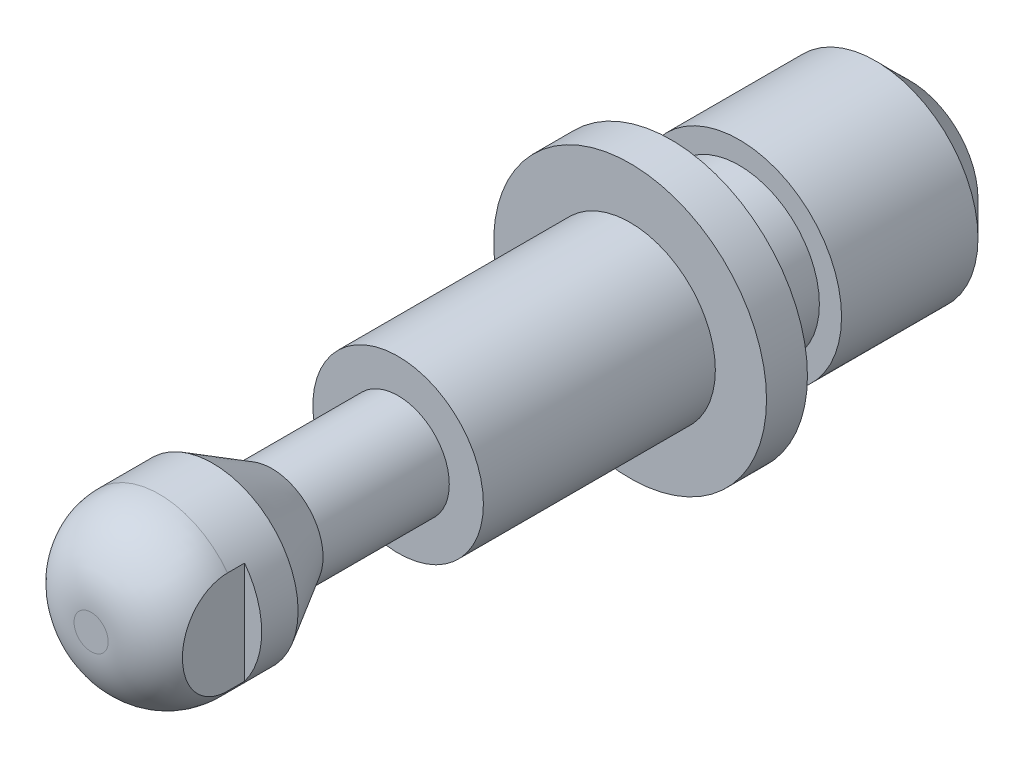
ISO-10303-21;
HEADER;
FILE_DESCRIPTION(('STEP AP214'),'2;1');
FILE_NAME('part.step','',(''),(''),'','','');
FILE_SCHEMA(('AUTOMOTIVE_DESIGN { 1 0 10303 214 1 1 1 1 }'));
ENDSEC;
DATA;
#1=APPLICATION_CONTEXT('core data for automotive mechanical design processes');
#2=APPLICATION_PROTOCOL_DEFINITION('international standard','automotive_design',2000,#1);
#3=PRODUCT_CONTEXT('',#1,'mechanical');
#4=PRODUCT('Part','Part','',(#3));
#5=PRODUCT_RELATED_PRODUCT_CATEGORY('part','',(#4));
#6=PRODUCT_DEFINITION_FORMATION('','',#4);
#7=PRODUCT_DEFINITION_CONTEXT('part definition',#1,'design');
#8=PRODUCT_DEFINITION('design','',#6,#7);
#9=PRODUCT_DEFINITION_SHAPE('','',#8);
#10=(LENGTH_UNIT() NAMED_UNIT(*) SI_UNIT(.MILLI.,.METRE.));
#11=(NAMED_UNIT(*) PLANE_ANGLE_UNIT() SI_UNIT($,.RADIAN.));
#12=(NAMED_UNIT(*) SI_UNIT($,.STERADIAN.) SOLID_ANGLE_UNIT());
#13=UNCERTAINTY_MEASURE_WITH_UNIT(LENGTH_MEASURE(1.E-05),#10,'distance_accuracy_value','');
#14=(GEOMETRIC_REPRESENTATION_CONTEXT(3) GLOBAL_UNCERTAINTY_ASSIGNED_CONTEXT((#13)) GLOBAL_UNIT_ASSIGNED_CONTEXT((#10,
#11,#12)) REPRESENTATION_CONTEXT('',''));
#15=CARTESIAN_POINT('',(0.,0.,0.));
#16=DIRECTION('',(0.,0.,1.));
#17=DIRECTION('',(1.,0.,0.));
#18=AXIS2_PLACEMENT_3D('',#15,#16,#17);
#19=CARTESIAN_POINT('',(0.,0.,0.));
#20=DIRECTION('',(0.,0.,-1.));
#21=DIRECTION('',(1.,0.,0.));
#22=AXIS2_PLACEMENT_3D('',#19,#20,#21);
#23=CYLINDRICAL_SURFACE('',#22,4.);
#24=CARTESIAN_POINT('',(0.,0.,0.));
#25=DIRECTION('',(0.,0.,-1.));
#26=DIRECTION('',(1.,0.,0.));
#27=AXIS2_PLACEMENT_3D('',#24,#25,#26);
#28=CIRCLE('',#27,4.);
#29=CARTESIAN_POINT('',(4.,0.,0.));
#30=VERTEX_POINT('',#29);
#31=EDGE_CURVE('E92',#30,#30,#28,.T.);
#32=ORIENTED_EDGE('',*,*,#31,.F.);
#33=EDGE_LOOP('',(#32));
#34=FACE_BOUND('',#33,.T.);
#35=CARTESIAN_POINT('',(0.,0.,1.2));
#36=DIRECTION('',(0.,0.,-1.));
#37=DIRECTION('',(1.,0.,0.));
#38=AXIS2_PLACEMENT_3D('',#35,#36,#37);
#39=CIRCLE('',#38,4.);
#40=CARTESIAN_POINT('',(4.,0.,1.2));
#41=VERTEX_POINT('',#40);
#42=EDGE_CURVE('E128',#41,#41,#39,.T.);
#43=ORIENTED_EDGE('',*,*,#42,.T.);
#44=EDGE_LOOP('',(#43));
#45=FACE_BOUND('',#44,.T.);
#46=ADVANCED_FACE('F15',(#34,#45),#23,.T.);
#47=CARTESIAN_POINT('',(0.,-4.,1.2));
#48=DIRECTION('',(0.,0.,-1.));
#49=DIRECTION('',(1.,0.,0.));
#50=AXIS2_PLACEMENT_3D('',#47,#48,#49);
#51=PLANE('',#50);
#52=ORIENTED_EDGE('',*,*,#42,.F.);
#53=EDGE_LOOP('',(#52));
#54=FACE_BOUND('',#53,.T.);
#55=CARTESIAN_POINT('',(0.,0.,1.2));
#56=DIRECTION('',(0.,0.,-1.));
#57=DIRECTION('',(1.,0.,0.));
#58=AXIS2_PLACEMENT_3D('',#55,#56,#57);
#59=CIRCLE('',#58,2.5);
#60=CARTESIAN_POINT('',(2.5,0.,1.2));
#61=VERTEX_POINT('',#60);
#62=EDGE_CURVE('E124',#61,#61,#59,.T.);
#63=ORIENTED_EDGE('',*,*,#62,.T.);
#64=EDGE_LOOP('',(#63));
#65=FACE_BOUND('',#64,.T.);
#66=ADVANCED_FACE('F181',(#54,#65),#51,.F.);
#67=CARTESIAN_POINT('',(0.,0.,0.));
#68=DIRECTION('',(0.,0.,-1.));
#69=DIRECTION('',(1.,0.,0.));
#70=AXIS2_PLACEMENT_3D('',#67,#68,#69);
#71=CYLINDRICAL_SURFACE('',#70,2.5);
#72=ORIENTED_EDGE('',*,*,#62,.F.);
#73=EDGE_LOOP('',(#72));
#74=FACE_BOUND('',#73,.T.);
#75=CARTESIAN_POINT('',(0.,0.,8.));
#76=DIRECTION('',(0.,0.,-1.));
#77=DIRECTION('',(1.,0.,0.));
#78=AXIS2_PLACEMENT_3D('',#75,#76,#77);
#79=CIRCLE('',#78,2.5);
#80=CARTESIAN_POINT('',(2.5,0.,8.));
#81=VERTEX_POINT('',#80);
#82=EDGE_CURVE('E120',#81,#81,#79,.T.);
#83=ORIENTED_EDGE('',*,*,#82,.T.);
#84=EDGE_LOOP('',(#83));
#85=FACE_BOUND('',#84,.T.);
#86=ADVANCED_FACE('F187',(#74,#85),#71,.T.);
#87=CARTESIAN_POINT('',(0.,-1.5,8.));
#88=DIRECTION('',(0.,0.,-1.));
#89=DIRECTION('',(1.,0.,0.));
#90=AXIS2_PLACEMENT_3D('',#87,#88,#89);
#91=PLANE('',#90);
#92=ORIENTED_EDGE('',*,*,#82,.F.);
#93=EDGE_LOOP('',(#92));
#94=FACE_BOUND('',#93,.T.);
#95=CARTESIAN_POINT('',(0.,0.,8.));
#96=DIRECTION('',(0.,0.,-1.));
#97=DIRECTION('',(1.,0.,0.));
#98=AXIS2_PLACEMENT_3D('',#95,#96,#97);
#99=CIRCLE('',#98,1.5);
#100=CARTESIAN_POINT('',(1.5,0.,8.));
#101=VERTEX_POINT('',#100);
#102=EDGE_CURVE('E116',#101,#101,#99,.T.);
#103=ORIENTED_EDGE('',*,*,#102,.T.);
#104=EDGE_LOOP('',(#103));
#105=FACE_BOUND('',#104,.T.);
#106=ADVANCED_FACE('F195',(#94,#105),#91,.F.);
#107=CARTESIAN_POINT('',(0.,0.,0.));
#108=DIRECTION('',(0.,0.,-1.));
#109=DIRECTION('',(1.,0.,0.));
#110=AXIS2_PLACEMENT_3D('',#107,#108,#109);
#111=CYLINDRICAL_SURFACE('',#110,1.5);
#112=ORIENTED_EDGE('',*,*,#102,.F.);
#113=EDGE_LOOP('',(#112));
#114=FACE_BOUND('',#113,.T.);
#115=CARTESIAN_POINT('',(0.,0.,11.7));
#116=DIRECTION('',(0.,0.,-1.));
#117=DIRECTION('',(1.,0.,0.));
#118=AXIS2_PLACEMENT_3D('',#115,#116,#117);
#119=CIRCLE('',#118,1.5);
#120=CARTESIAN_POINT('',(1.5,0.,11.7));
#121=VERTEX_POINT('',#120);
#122=EDGE_CURVE('E112',#121,#121,#119,.T.);
#123=ORIENTED_EDGE('',*,*,#122,.T.);
#124=EDGE_LOOP('',(#123));
#125=FACE_BOUND('',#124,.T.);
#126=ADVANCED_FACE('F199',(#114,#125),#111,.T.);
#127=CARTESIAN_POINT('',(0.,0.,13.4320508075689));
#128=DIRECTION('',(0.,0.,1.));
#129=DIRECTION('',(-1.,0.,0.));
#130=AXIS2_PLACEMENT_3D('',#127,#128,#129);
#131=CONICAL_SURFACE('',#130,2.5,0.523598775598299);
#132=ORIENTED_EDGE('',*,*,#122,.F.);
#133=EDGE_LOOP('',(#132));
#134=FACE_BOUND('',#133,.T.);
#135=CARTESIAN_POINT('',(0.,0.,13.4320508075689));
#136=DIRECTION('',(0.,0.,-1.));
#137=DIRECTION('',(1.,0.,0.));
#138=AXIS2_PLACEMENT_3D('',#135,#136,#137);
#139=CIRCLE('',#138,2.5);
#140=CARTESIAN_POINT('',(2.5,0.,13.4320508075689));
#141=VERTEX_POINT('',#140);
#142=EDGE_CURVE('E108',#141,#141,#139,.T.);
#143=ORIENTED_EDGE('',*,*,#142,.T.);
#144=EDGE_LOOP('',(#143));
#145=FACE_BOUND('',#144,.T.);
#146=ADVANCED_FACE('F203',(#134,#145),#131,.T.);
#147=CARTESIAN_POINT('',(0.,0.,0.));
#148=DIRECTION('',(0.,0.,-1.));
#149=DIRECTION('',(1.,0.,0.));
#150=AXIS2_PLACEMENT_3D('',#147,#148,#149);
#151=CYLINDRICAL_SURFACE('',#150,2.5);
#152=CARTESIAN_POINT('',(0.,0.,15.));
#153=DIRECTION('',(0.,0.,-1.));
#154=DIRECTION('',(1.,0.,0.));
#155=AXIS2_PLACEMENT_3D('',#152,#153,#154);
#156=CIRCLE('',#155,2.5);
#157=CARTESIAN_POINT('',(-2.,1.50000000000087,15.));
#158=VERTEX_POINT('',#157);
#159=CARTESIAN_POINT('',(2.,1.5,15.));
#160=VERTEX_POINT('',#159);
#161=EDGE_CURVE('E75',#158,#160,#156,.T.);
#162=ORIENTED_EDGE('',*,*,#161,.T.);
#163=DIRECTION('',(0.,0.,-1.));
#164=VECTOR('',#163,1.);
#165=CARTESIAN_POINT('',(2.,1.5,0.));
#166=LINE('',#165,#164);
#167=CARTESIAN_POINT('',(2.,1.5,14.5));
#168=VERTEX_POINT('',#167);
#169=EDGE_CURVE('E31',#160,#168,#166,.T.);
#170=ORIENTED_EDGE('',*,*,#169,.T.);
#171=CARTESIAN_POINT('',(0.,0.,14.5));
#172=DIRECTION('',(0.,0.,-1.));
#173=DIRECTION('',(1.,0.,0.));
#174=AXIS2_PLACEMENT_3D('',#171,#172,#173);
#175=CIRCLE('',#174,2.5);
#176=CARTESIAN_POINT('',(2.,-1.5,14.5));
#177=VERTEX_POINT('',#176);
#178=EDGE_CURVE('E60',#168,#177,#175,.T.);
#179=ORIENTED_EDGE('',*,*,#178,.T.);
#180=DIRECTION('',(0.,0.,-1.));
#181=VECTOR('',#180,1.);
#182=CARTESIAN_POINT('',(2.,-1.5,0.));
#183=LINE('',#182,#181);
#184=CARTESIAN_POINT('',(2.,-1.50000000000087,15.));
#185=VERTEX_POINT('',#184);
#186=EDGE_CURVE('E67',#177,#185,#183,.F.);
#187=ORIENTED_EDGE('',*,*,#186,.T.);
#188=CARTESIAN_POINT('',(-2.,-1.5,15.));
#189=VERTEX_POINT('',#188);
#190=EDGE_CURVE('E39',#185,#189,#156,.T.);
#191=ORIENTED_EDGE('',*,*,#190,.T.);
#192=DIRECTION('',(0.,0.,-1.));
#193=VECTOR('',#192,1.);
#194=CARTESIAN_POINT('',(-2.,-1.5,0.));
#195=LINE('',#194,#193);
#196=CARTESIAN_POINT('',(-2.,-1.5,14.5));
#197=VERTEX_POINT('',#196);
#198=EDGE_CURVE('E89',#189,#197,#195,.T.);
#199=ORIENTED_EDGE('',*,*,#198,.T.);
#200=CARTESIAN_POINT('',(0.,0.,14.5));
#201=DIRECTION('',(0.,0.,-1.));
#202=DIRECTION('',(1.,0.,0.));
#203=AXIS2_PLACEMENT_3D('',#200,#201,#202);
#204=CIRCLE('',#203,2.5);
#205=CARTESIAN_POINT('',(-2.,1.5,14.5));
#206=VERTEX_POINT('',#205);
#207=EDGE_CURVE('E146',#197,#206,#204,.T.);
#208=ORIENTED_EDGE('',*,*,#207,.T.);
#209=DIRECTION('',(0.,0.,-1.));
#210=VECTOR('',#209,1.);
#211=CARTESIAN_POINT('',(-2.,1.5,0.));
#212=LINE('',#211,#210);
#213=EDGE_CURVE('E83',#206,#158,#212,.F.);
#214=ORIENTED_EDGE('',*,*,#213,.T.);
#215=EDGE_LOOP('',(#162,#170,#179,#187,#191,#199,#208,#214));
#216=FACE_BOUND('',#215,.T.);
#217=ORIENTED_EDGE('',*,*,#142,.F.);
#218=EDGE_LOOP('',(#217));
#219=FACE_BOUND('',#218,.T.);
#220=ADVANCED_FACE('F71',(#216,#219),#151,.T.);
#221=CARTESIAN_POINT('',(0.,0.,17.));
#222=DIRECTION('',(0.,0.,-1.));
#223=DIRECTION('',(1.,0.,0.));
#224=AXIS2_PLACEMENT_3D('',#221,#222,#223);
#225=PLANE('',#224);
#226=CARTESIAN_POINT('',(0.,0.,17.));
#227=DIRECTION('',(0.,0.,-1.));
#228=DIRECTION('',(1.,0.,0.));
#229=AXIS2_PLACEMENT_3D('',#226,#227,#228);
#230=CIRCLE('',#229,0.5);
#231=CARTESIAN_POINT('',(0.500000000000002,0.,17.));
#232=VERTEX_POINT('',#231);
#233=EDGE_CURVE('E134',#232,#232,#230,.F.);
#234=ORIENTED_EDGE('',*,*,#233,.T.);
#235=EDGE_LOOP('',(#234));
#236=FACE_BOUND('',#235,.T.);
#237=ADVANCED_FACE('F210',(#236),#225,.F.);
#238=CARTESIAN_POINT('',(0.,-3.,-7.));
#239=DIRECTION('',(0.,0.,1.));
#240=DIRECTION('',(-1.,0.,0.));
#241=AXIS2_PLACEMENT_3D('',#238,#239,#240);
#242=PLANE('',#241);
#243=CARTESIAN_POINT('',(0.,0.,-7.));
#244=DIRECTION('',(0.,0.,1.));
#245=DIRECTION('',(1.,0.,0.));
#246=AXIS2_PLACEMENT_3D('',#243,#244,#245);
#247=CIRCLE('',#246,2.);
#248=CARTESIAN_POINT('',(2.,0.,-7.));
#249=VERTEX_POINT('',#248);
#250=EDGE_CURVE('E24',#249,#249,#247,.F.);
#251=ORIENTED_EDGE('',*,*,#250,.T.);
#252=EDGE_LOOP('',(#251));
#253=FACE_BOUND('',#252,.T.);
#254=ADVANCED_FACE('F171',(#253),#242,.F.);
#255=CARTESIAN_POINT('',(0.,0.,0.));
#256=DIRECTION('',(0.,0.,-1.));
#257=DIRECTION('',(1.,0.,0.));
#258=AXIS2_PLACEMENT_3D('',#255,#256,#257);
#259=CYLINDRICAL_SURFACE('',#258,3.);
#260=CARTESIAN_POINT('',(0.,0.,-6.));
#261=DIRECTION('',(0.,0.,1.));
#262=DIRECTION('',(1.,0.,0.));
#263=AXIS2_PLACEMENT_3D('',#260,#261,#262);
#264=CIRCLE('',#263,3.);
#265=CARTESIAN_POINT('',(3.,0.,-6.));
#266=VERTEX_POINT('',#265);
#267=EDGE_CURVE('E9',#266,#266,#264,.T.);
#268=ORIENTED_EDGE('',*,*,#267,.T.);
#269=EDGE_LOOP('',(#268));
#270=FACE_BOUND('',#269,.T.);
#271=CARTESIAN_POINT('',(0.,0.,-2.));
#272=DIRECTION('',(0.,0.,-1.));
#273=DIRECTION('',(1.,0.,0.));
#274=AXIS2_PLACEMENT_3D('',#271,#272,#273);
#275=CIRCLE('',#274,3.);
#276=CARTESIAN_POINT('',(3.,0.,-2.));
#277=VERTEX_POINT('',#276);
#278=EDGE_CURVE('E104',#277,#277,#275,.T.);
#279=ORIENTED_EDGE('',*,*,#278,.T.);
#280=EDGE_LOOP('',(#279));
#281=FACE_BOUND('',#280,.T.);
#282=ADVANCED_FACE('F216',(#270,#281),#259,.T.);
#283=CARTESIAN_POINT('',(0.,-2.35,-2.));
#284=DIRECTION('',(0.,0.,-1.));
#285=DIRECTION('',(1.,0.,0.));
#286=AXIS2_PLACEMENT_3D('',#283,#284,#285);
#287=PLANE('',#286);
#288=ORIENTED_EDGE('',*,*,#278,.F.);
#289=EDGE_LOOP('',(#288));
#290=FACE_BOUND('',#289,.T.);
#291=CARTESIAN_POINT('',(0.,0.,-2.));
#292=DIRECTION('',(0.,0.,-1.));
#293=DIRECTION('',(1.,0.,0.));
#294=AXIS2_PLACEMENT_3D('',#291,#292,#293);
#295=CIRCLE('',#294,2.35);
#296=CARTESIAN_POINT('',(2.35,0.,-2.));
#297=VERTEX_POINT('',#296);
#298=EDGE_CURVE('E100',#297,#297,#295,.T.);
#299=ORIENTED_EDGE('',*,*,#298,.T.);
#300=EDGE_LOOP('',(#299));
#301=FACE_BOUND('',#300,.T.);
#302=ADVANCED_FACE('F219',(#290,#301),#287,.F.);
#303=CARTESIAN_POINT('',(0.,0.,0.));
#304=DIRECTION('',(0.,0.,-1.));
#305=DIRECTION('',(1.,0.,0.));
#306=AXIS2_PLACEMENT_3D('',#303,#304,#305);
#307=CYLINDRICAL_SURFACE('',#306,2.35);
#308=ORIENTED_EDGE('',*,*,#298,.F.);
#309=EDGE_LOOP('',(#308));
#310=FACE_BOUND('',#309,.T.);
#311=CARTESIAN_POINT('',(0.,0.,0.));
#312=DIRECTION('',(0.,0.,-1.));
#313=DIRECTION('',(1.,0.,0.));
#314=AXIS2_PLACEMENT_3D('',#311,#312,#313);
#315=CIRCLE('',#314,2.35);
#316=CARTESIAN_POINT('',(2.35,0.,0.));
#317=VERTEX_POINT('',#316);
#318=EDGE_CURVE('E96',#317,#317,#315,.T.);
#319=ORIENTED_EDGE('',*,*,#318,.T.);
#320=EDGE_LOOP('',(#319));
#321=FACE_BOUND('',#320,.T.);
#322=ADVANCED_FACE('F223',(#310,#321),#307,.T.);
#323=CARTESIAN_POINT('',(0.,-2.35,0.));
#324=DIRECTION('',(0.,0.,1.));
#325=DIRECTION('',(-1.,0.,0.));
#326=AXIS2_PLACEMENT_3D('',#323,#324,#325);
#327=PLANE('',#326);
#328=ORIENTED_EDGE('',*,*,#318,.F.);
#329=EDGE_LOOP('',(#328));
#330=FACE_BOUND('',#329,.T.);
#331=ORIENTED_EDGE('',*,*,#31,.T.);
#332=EDGE_LOOP('',(#331));
#333=FACE_BOUND('',#332,.T.);
#334=ADVANCED_FACE('F226',(#330,#333),#327,.F.);
#335=CARTESIAN_POINT('',(0.,0.,15.));
#336=DIRECTION('',(0.,0.,-1.));
#337=DIRECTION('',(1.,0.,0.));
#338=AXIS2_PLACEMENT_3D('',#335,#336,#337);
#339=DEGENERATE_TOROIDAL_SURFACE('',#338,0.5,2.,.T.);
#340=CARTESIAN_POINT('',(2.,0.,16.3228756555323));
#341=CARTESIAN_POINT('',(2.,-0.10228286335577,16.3228758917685));
#342=CARTESIAN_POINT('',(2.,-0.204694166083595,16.3139867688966));
#343=CARTESIAN_POINT('',(2.,-0.406512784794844,16.2781707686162));
#344=CARTESIAN_POINT('',(2.,-0.505914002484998,16.2512095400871));
#345=CARTESIAN_POINT('',(2.,-0.692258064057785,16.1809929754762));
#346=CARTESIAN_POINT('',(2.,-0.779589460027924,16.1387810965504));
#347=CARTESIAN_POINT('',(2.,-0.944367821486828,16.0382236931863));
#348=CARTESIAN_POINT('',(2.,-1.02183096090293,15.9799050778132));
#349=CARTESIAN_POINT('',(2.,-1.15377375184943,15.8568418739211));
#350=CARTESIAN_POINT('',(2.,-1.20992899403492,15.7938951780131));
#351=CARTESIAN_POINT('',(2.,-1.30903611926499,15.6583285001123));
#352=CARTESIAN_POINT('',(2.,-1.35199840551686,15.5857162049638));
#353=CARTESIAN_POINT('',(2.,-1.41803440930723,15.4428853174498));
#354=CARTESIAN_POINT('',(2.,-1.44292272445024,15.3735017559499));
#355=CARTESIAN_POINT('',(2.,-1.47976583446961,15.2313867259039));
#356=CARTESIAN_POINT('',(2.,-1.49172712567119,15.1586569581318));
#357=CARTESIAN_POINT('',(2.,-1.50183363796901,15.0171132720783));
#358=CARTESIAN_POINT('',(2.,-1.50084260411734,14.9483595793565));
#359=CARTESIAN_POINT('',(2.,-1.48717054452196,14.8120331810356));
#360=CARTESIAN_POINT('',(2.,-1.47449130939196,14.7444602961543));
#361=CARTESIAN_POINT('',(2.,-1.43817755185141,14.6132392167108));
#362=CARTESIAN_POINT('',(2.,-1.41468005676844,14.5495528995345));
#363=CARTESIAN_POINT('',(2.,-1.35766202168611,14.4268515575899));
#364=CARTESIAN_POINT('',(2.,-1.32414065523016,14.3678369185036));
#365=CARTESIAN_POINT('',(2.,-1.2469695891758,14.2539324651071));
#366=CARTESIAN_POINT('',(2.,-1.20301666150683,14.1992486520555));
#367=CARTESIAN_POINT('',(2.,-1.10716106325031,14.0973841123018));
#368=CARTESIAN_POINT('',(2.,-1.05525631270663,14.0502053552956));
#369=CARTESIAN_POINT('',(2.,-0.940758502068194,13.960658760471));
#370=CARTESIAN_POINT('',(2.,-0.877647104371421,13.9189552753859));
#371=CARTESIAN_POINT('',(2.,-0.745920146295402,13.8454442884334));
#372=CARTESIAN_POINT('',(2.,-0.677302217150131,13.8136410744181));
#373=CARTESIAN_POINT('',(2.,-0.527914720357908,13.7567980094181));
#374=CARTESIAN_POINT('',(2.,-0.446669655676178,13.7330094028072));
#375=CARTESIAN_POINT('',(2.,-0.281546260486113,13.6977114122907));
#376=CARTESIAN_POINT('',(2.,-0.197666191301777,13.6862103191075));
#377=CARTESIAN_POINT('',(2.,-0.0185671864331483,13.674659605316));
#378=CARTESIAN_POINT('',(2.,0.0767589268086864,13.6762204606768));
#379=CARTESIAN_POINT('',(2.,0.265956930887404,13.6947387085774));
#380=CARTESIAN_POINT('',(2.,0.359828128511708,13.7117032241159));
#381=CARTESIAN_POINT('',(2.,0.54632967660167,13.762114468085));
#382=CARTESIAN_POINT('',(2.,0.638825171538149,13.7960691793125));
#383=CARTESIAN_POINT('',(2.,0.815765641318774,13.8808497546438));
#384=CARTESIAN_POINT('',(2.,0.900217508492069,13.9316610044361));
#385=CARTESIAN_POINT('',(2.,1.0486011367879,14.0432052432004));
#386=CARTESIAN_POINT('',(2.,1.11376119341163,14.1022988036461));
#387=CARTESIAN_POINT('',(2.,1.2312760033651,14.2320942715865));
#388=CARTESIAN_POINT('',(2.,1.28364363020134,14.3027843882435));
#389=CARTESIAN_POINT('',(2.,1.3667065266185,14.4432157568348));
#390=CARTESIAN_POINT('',(2.,1.39937412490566,14.511794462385));
#391=CARTESIAN_POINT('',(2.,1.45154611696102,14.6537870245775));
#392=CARTESIAN_POINT('',(2.,1.47105823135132,14.7271980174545));
#393=CARTESIAN_POINT('',(2.,1.49497029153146,14.8701916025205));
#394=CARTESIAN_POINT('',(2.,1.50048503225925,14.9395897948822));
#395=CARTESIAN_POINT('',(2.,1.49944838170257,15.0782881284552));
#396=CARTESIAN_POINT('',(2.,1.49289984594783,15.1475882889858));
#397=CARTESIAN_POINT('',(2.,1.46833269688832,15.2822688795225));
#398=CARTESIAN_POINT('',(2.,1.4506129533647,15.3477042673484));
#399=CARTESIAN_POINT('',(2.,1.40466413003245,15.4747634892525));
#400=CARTESIAN_POINT('',(2.,1.37643461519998,15.536387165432));
#401=CARTESIAN_POINT('',(2.,1.30977280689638,15.6555979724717));
#402=CARTESIAN_POINT('',(2.,1.27113180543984,15.7130680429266));
#403=CARTESIAN_POINT('',(2.,1.18531026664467,15.8212046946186));
#404=CARTESIAN_POINT('',(2.,1.13812853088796,15.8718703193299));
#405=CARTESIAN_POINT('',(2.,1.03335725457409,15.9686437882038));
#406=CARTESIAN_POINT('',(2.,0.975285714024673,16.0142284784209));
#407=CARTESIAN_POINT('',(2.,0.852927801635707,16.0961331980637));
#408=CARTESIAN_POINT('',(2.,0.788636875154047,16.1324463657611));
#409=CARTESIAN_POINT('',(2.,0.648264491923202,16.199051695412));
#410=CARTESIAN_POINT('',(2.,0.571663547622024,16.228244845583));
#411=CARTESIAN_POINT('',(2.,0.415079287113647,16.2749849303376));
#412=CARTESIAN_POINT('',(2.,0.335099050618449,16.2925422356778));
#413=CARTESIAN_POINT('',(2.,0.212244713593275,16.3105569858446));
#414=CARTESIAN_POINT('',(2.,0.169937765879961,16.3151768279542));
#415=CARTESIAN_POINT('',(2.,0.0850946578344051,16.32133646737));
#416=CARTESIAN_POINT('',(2.,0.0425584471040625,16.3228755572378));
#417=CARTESIAN_POINT('',(2.,0.,16.3228756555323));
#418=B_SPLINE_CURVE_WITH_KNOTS('',3,(#340,#341,#342,#343,#344,#345,#346,#347,#348,#349,#350,
#351,#352,#353,#354,#355,#356,#357,#358,#359,#360,#361,#362,#363,#364,#365,#366,#367,#368,#369,
#370,#371,#372,#373,#374,#375,#376,#377,#378,#379,#380,#381,#382,#383,#384,#385,#386,#387,#388,
#389,#390,#391,#392,#393,#394,#395,#396,#397,#398,#399,#400,#401,#402,#403,#404,#405,#406,#407,
#408,#409,#410,#411,#412,#413,#414,#415,#416,#417),.UNSPECIFIED.,.T.,.F.,(4,2,2,2,2,2,2,2,2,2,2,
2,2,2,2,2,2,2,2,2,2,2,2,2,2,2,2,2,2,2,2,2,2,2,2,2,2,2,4),(0.,0.306678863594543,
0.613942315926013,0.903262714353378,1.19210264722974,1.44370292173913,1.69510428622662,
1.91508563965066,2.13495639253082,2.34024400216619,2.54550016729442,2.74822514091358,
2.95096683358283,3.16054022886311,3.37016853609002,3.59618340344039,3.82229602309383,
4.07525351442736,4.32838157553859,4.61313893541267,4.89802804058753,5.19199518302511,
5.4857081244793,5.74804939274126,6.01012555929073,6.23678799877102,6.46331729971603,
6.67114182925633,6.87891717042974,7.08135684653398,7.28380490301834,7.49065963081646,
7.6975434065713,7.91811168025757,8.13884272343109,8.38381180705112,8.62856226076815,
8.75613768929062,8.88374240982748),.UNSPECIFIED.);
#419=EDGE_CURVE('E64',#160,#185,#418,.T.);
#420=ORIENTED_EDGE('',*,*,#419,.F.);
#421=ORIENTED_EDGE('',*,*,#161,.F.);
#422=CARTESIAN_POINT('',(-2.,0.,16.3228756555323));
#423=CARTESIAN_POINT('',(-2.,0.102282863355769,16.3228758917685));
#424=CARTESIAN_POINT('',(-2.,0.204694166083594,16.3139867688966));
#425=CARTESIAN_POINT('',(-2.,0.406512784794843,16.2781707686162));
#426=CARTESIAN_POINT('',(-2.,0.505914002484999,16.2512095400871));
#427=CARTESIAN_POINT('',(-2.,0.692258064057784,16.1809929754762));
#428=CARTESIAN_POINT('',(-2.,0.779589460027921,16.1387810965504));
#429=CARTESIAN_POINT('',(-2.,0.944367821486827,16.0382236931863));
#430=CARTESIAN_POINT('',(-2.,1.02183096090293,15.9799050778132));
#431=CARTESIAN_POINT('',(-2.,1.15377375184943,15.8568418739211));
#432=CARTESIAN_POINT('',(-2.,1.20992899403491,15.7938951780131));
#433=CARTESIAN_POINT('',(-2.,1.30903611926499,15.6583285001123));
#434=CARTESIAN_POINT('',(-2.,1.35199840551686,15.5857162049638));
#435=CARTESIAN_POINT('',(-2.,1.41803440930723,15.4428853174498));
#436=CARTESIAN_POINT('',(-2.,1.44292272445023,15.3735017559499));
#437=CARTESIAN_POINT('',(-2.,1.47976583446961,15.2313867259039));
#438=CARTESIAN_POINT('',(-2.,1.49172712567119,15.1586569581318));
#439=CARTESIAN_POINT('',(-2.,1.50183363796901,15.0171132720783));
#440=CARTESIAN_POINT('',(-2.,1.50084260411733,14.9483595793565));
#441=CARTESIAN_POINT('',(-2.,1.48717054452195,14.8120331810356));
#442=CARTESIAN_POINT('',(-2.,1.47449130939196,14.7444602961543));
#443=CARTESIAN_POINT('',(-2.,1.43817755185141,14.6132392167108));
#444=CARTESIAN_POINT('',(-2.,1.41468005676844,14.5495528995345));
#445=CARTESIAN_POINT('',(-2.,1.35766202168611,14.4268515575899));
#446=CARTESIAN_POINT('',(-2.,1.32414065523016,14.3678369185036));
#447=CARTESIAN_POINT('',(-2.,1.2469695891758,14.2539324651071));
#448=CARTESIAN_POINT('',(-2.,1.20301666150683,14.1992486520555));
#449=CARTESIAN_POINT('',(-2.,1.10716106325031,14.0973841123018));
#450=CARTESIAN_POINT('',(-2.,1.05525631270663,14.0502053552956));
#451=CARTESIAN_POINT('',(-2.,0.940758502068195,13.960658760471));
#452=CARTESIAN_POINT('',(-2.,0.877647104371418,13.9189552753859));
#453=CARTESIAN_POINT('',(-2.,0.745920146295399,13.8454442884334));
#454=CARTESIAN_POINT('',(-2.,0.67730221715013,13.8136410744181));
#455=CARTESIAN_POINT('',(-2.,0.527914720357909,13.7567980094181));
#456=CARTESIAN_POINT('',(-2.,0.446669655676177,13.7330094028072));
#457=CARTESIAN_POINT('',(-2.,0.281546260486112,13.6977114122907));
#458=CARTESIAN_POINT('',(-2.,0.197666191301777,13.6862103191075));
#459=CARTESIAN_POINT('',(-2.,0.0185671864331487,13.674659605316));
#460=CARTESIAN_POINT('',(-2.,-0.0767589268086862,13.6762204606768));
#461=CARTESIAN_POINT('',(-2.,-0.265956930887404,13.6947387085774));
#462=CARTESIAN_POINT('',(-2.,-0.359828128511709,13.7117032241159));
#463=CARTESIAN_POINT('',(-2.,-0.546329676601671,13.762114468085));
#464=CARTESIAN_POINT('',(-2.,-0.638825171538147,13.7960691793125));
#465=CARTESIAN_POINT('',(-2.,-0.815765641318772,13.8808497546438));
#466=CARTESIAN_POINT('',(-2.,-0.900217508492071,13.9316610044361));
#467=CARTESIAN_POINT('',(-2.,-1.0486011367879,14.0432052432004));
#468=CARTESIAN_POINT('',(-2.,-1.11376119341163,14.1022988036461));
#469=CARTESIAN_POINT('',(-2.,-1.23127600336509,14.2320942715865));
#470=CARTESIAN_POINT('',(-2.,-1.28364363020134,14.3027843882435));
#471=CARTESIAN_POINT('',(-2.,-1.3667065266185,14.4432157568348));
#472=CARTESIAN_POINT('',(-2.,-1.39937412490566,14.511794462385));
#473=CARTESIAN_POINT('',(-2.,-1.45154611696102,14.6537870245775));
#474=CARTESIAN_POINT('',(-2.,-1.47105823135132,14.7271980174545));
#475=CARTESIAN_POINT('',(-2.,-1.49497029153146,14.8701916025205));
#476=CARTESIAN_POINT('',(-2.,-1.50048503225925,14.9395897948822));
#477=CARTESIAN_POINT('',(-2.,-1.49944838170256,15.0782881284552));
#478=CARTESIAN_POINT('',(-2.,-1.49289984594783,15.1475882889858));
#479=CARTESIAN_POINT('',(-2.,-1.46833269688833,15.2822688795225));
#480=CARTESIAN_POINT('',(-2.,-1.4506129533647,15.3477042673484));
#481=CARTESIAN_POINT('',(-2.,-1.40466413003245,15.4747634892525));
#482=CARTESIAN_POINT('',(-2.,-1.37643461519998,15.536387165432));
#483=CARTESIAN_POINT('',(-2.,-1.30977280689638,15.6555979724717));
#484=CARTESIAN_POINT('',(-2.,-1.27113180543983,15.7130680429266));
#485=CARTESIAN_POINT('',(-2.,-1.18531026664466,15.8212046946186));
#486=CARTESIAN_POINT('',(-2.,-1.13812853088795,15.8718703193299));
#487=CARTESIAN_POINT('',(-2.,-1.03335725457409,15.9686437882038));
#488=CARTESIAN_POINT('',(-2.,-0.975285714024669,16.0142284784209));
#489=CARTESIAN_POINT('',(-2.,-0.852927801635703,16.0961331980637));
#490=CARTESIAN_POINT('',(-2.,-0.788636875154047,16.1324463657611));
#491=CARTESIAN_POINT('',(-2.,-0.648264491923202,16.199051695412));
#492=CARTESIAN_POINT('',(-2.,-0.571663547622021,16.228244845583));
#493=CARTESIAN_POINT('',(-2.,-0.415079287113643,16.2749849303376));
#494=CARTESIAN_POINT('',(-2.,-0.335099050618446,16.2925422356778));
#495=CARTESIAN_POINT('',(-2.,-0.212244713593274,16.3105569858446));
#496=CARTESIAN_POINT('',(-2.,-0.16993776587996,16.3151768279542));
#497=CARTESIAN_POINT('',(-2.,-0.0850946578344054,16.32133646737));
#498=CARTESIAN_POINT('',(-2.,-0.0425584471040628,16.3228755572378));
#499=CARTESIAN_POINT('',(-2.,0.,16.3228756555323));
#500=B_SPLINE_CURVE_WITH_KNOTS('',3,(#422,#423,#424,#425,#426,#427,#428,#429,#430,#431,#432,
#433,#434,#435,#436,#437,#438,#439,#440,#441,#442,#443,#444,#445,#446,#447,#448,#449,#450,#451,
#452,#453,#454,#455,#456,#457,#458,#459,#460,#461,#462,#463,#464,#465,#466,#467,#468,#469,#470,
#471,#472,#473,#474,#475,#476,#477,#478,#479,#480,#481,#482,#483,#484,#485,#486,#487,#488,#489,
#490,#491,#492,#493,#494,#495,#496,#497,#498,#499),.UNSPECIFIED.,.T.,.F.,(4,2,2,2,2,2,2,2,2,2,2,
2,2,2,2,2,2,2,2,2,2,2,2,2,2,2,2,2,2,2,2,2,2,2,2,2,2,2,4),(0.,0.306678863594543,
0.613942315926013,0.903262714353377,1.19210264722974,1.44370292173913,1.69510428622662,
1.91508563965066,2.13495639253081,2.34024400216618,2.54550016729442,2.74822514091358,
2.95096683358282,3.1605402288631,3.37016853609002,3.59618340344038,3.82229602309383,
4.07525351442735,4.32838157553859,4.61313893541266,4.89802804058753,5.1919951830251,
5.48570812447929,5.74804939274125,6.01012555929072,6.23678799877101,6.46331729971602,
6.67114182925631,6.87891717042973,7.08135684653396,7.28380490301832,7.49065963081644,
7.69754340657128,7.91811168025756,8.13884272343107,8.3838118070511,8.62856226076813,
8.7561376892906,8.88374240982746),.UNSPECIFIED.);
#501=EDGE_CURVE('E138',#189,#158,#500,.T.);
#502=ORIENTED_EDGE('',*,*,#501,.F.);
#503=ORIENTED_EDGE('',*,*,#190,.F.);
#504=EDGE_LOOP('',(#420,#421,#502,#503));
#505=FACE_BOUND('',#504,.T.);
#506=ORIENTED_EDGE('',*,*,#233,.F.);
#507=EDGE_LOOP('',(#506));
#508=FACE_BOUND('',#507,.T.);
#509=ADVANCED_FACE('F148',(#505,#508),#339,.T.);
#510=CARTESIAN_POINT('',(-3.25,-2.5,14.5));
#511=DIRECTION('',(0.,0.,-1.));
#512=DIRECTION('',(1.,0.,0.));
#513=AXIS2_PLACEMENT_3D('',#510,#511,#512);
#514=PLANE('',#513);
#515=DIRECTION('',(0.,1.,0.));
#516=VECTOR('',#515,1.);
#517=CARTESIAN_POINT('',(-2.,-2.5,14.5));
#518=LINE('',#517,#516);
#519=EDGE_CURVE('E77',#197,#206,#518,.T.);
#520=ORIENTED_EDGE('',*,*,#519,.T.);
#521=ORIENTED_EDGE('',*,*,#207,.F.);
#522=EDGE_LOOP('',(#520,#521));
#523=FACE_BOUND('',#522,.T.);
#524=ADVANCED_FACE('F155',(#523),#514,.F.);
#525=CARTESIAN_POINT('',(-2.,-2.5,14.5));
#526=DIRECTION('',(1.,0.,0.));
#527=DIRECTION('',(0.,-1.,0.));
#528=AXIS2_PLACEMENT_3D('',#525,#526,#527);
#529=PLANE('',#528);
#530=ORIENTED_EDGE('',*,*,#501,.T.);
#531=ORIENTED_EDGE('',*,*,#213,.F.);
#532=ORIENTED_EDGE('',*,*,#519,.F.);
#533=ORIENTED_EDGE('',*,*,#198,.F.);
#534=EDGE_LOOP('',(#530,#531,#532,#533));
#535=FACE_BOUND('',#534,.T.);
#536=ADVANCED_FACE('F151',(#535),#529,.F.);
#537=CARTESIAN_POINT('',(2.,2.5,14.5));
#538=DIRECTION('',(0.,0.,-1.));
#539=DIRECTION('',(1.,0.,0.));
#540=AXIS2_PLACEMENT_3D('',#537,#538,#539);
#541=PLANE('',#540);
#542=DIRECTION('',(0.,-1.,0.));
#543=VECTOR('',#542,1.);
#544=CARTESIAN_POINT('',(2.,-2.5,14.5));
#545=LINE('',#544,#543);
#546=EDGE_CURVE('E62',#168,#177,#545,.T.);
#547=ORIENTED_EDGE('',*,*,#546,.T.);
#548=ORIENTED_EDGE('',*,*,#178,.F.);
#549=EDGE_LOOP('',(#547,#548));
#550=FACE_BOUND('',#549,.T.);
#551=ADVANCED_FACE('F61',(#550),#541,.F.);
#552=CARTESIAN_POINT('',(2.,-2.5,14.5));
#553=DIRECTION('',(-1.,0.,0.));
#554=DIRECTION('',(0.,1.,0.));
#555=AXIS2_PLACEMENT_3D('',#552,#553,#554);
#556=PLANE('',#555);
#557=ORIENTED_EDGE('',*,*,#419,.T.);
#558=ORIENTED_EDGE('',*,*,#186,.F.);
#559=ORIENTED_EDGE('',*,*,#546,.F.);
#560=ORIENTED_EDGE('',*,*,#169,.F.);
#561=EDGE_LOOP('',(#557,#558,#559,#560));
#562=FACE_BOUND('',#561,.T.);
#563=ADVANCED_FACE('F66',(#562),#556,.F.);
#564=CARTESIAN_POINT('',(0.,0.,-7.));
#565=DIRECTION('',(0.,0.,1.));
#566=DIRECTION('',(1.,0.,0.));
#567=AXIS2_PLACEMENT_3D('',#564,#565,#566);
#568=CONICAL_SURFACE('',#567,2.,0.785398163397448);
#569=ORIENTED_EDGE('',*,*,#267,.F.);
#570=EDGE_LOOP('',(#569));
#571=FACE_BOUND('',#570,.T.);
#572=ORIENTED_EDGE('',*,*,#250,.F.);
#573=EDGE_LOOP('',(#572));
#574=FACE_BOUND('',#573,.T.);
#575=ADVANCED_FACE('F17',(#571,#574),#568,.T.);
#576=CLOSED_SHELL('',(#46,#66,#86,#106,#126,#146,#220,#237,#254,#282,#302,#322,#334,#509,#524,
#536,#551,#563,#575));
#577=MANIFOLD_SOLID_BREP('B1',#576);
#578=ADVANCED_BREP_SHAPE_REPRESENTATION('',(#18,#577),#14);
#579=SHAPE_DEFINITION_REPRESENTATION(#9,#578);
ENDSEC;
END-ISO-10303-21;
